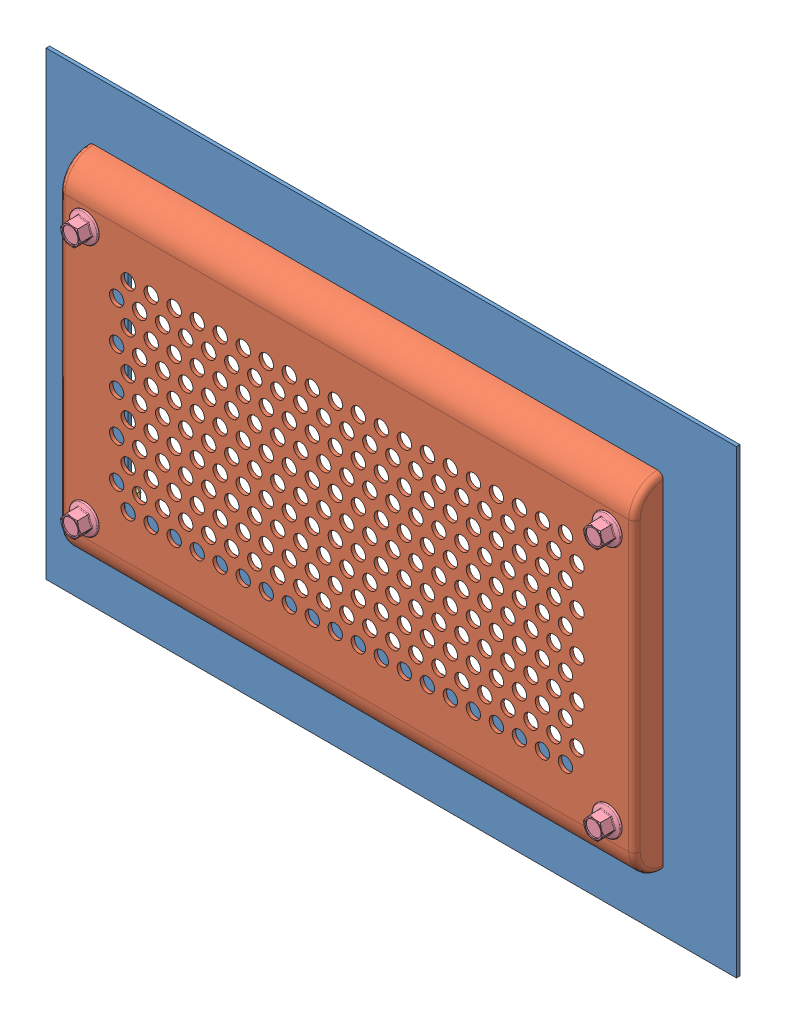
SolidWorks assembly temp cover assy.SLDASM, configuration Default (file format 4628). Lengths in mm.
Overall size (304.8 203.2 28.7).
10 component instances, 4 part files, 11 mates.
Components (placement in the parent):
- reference plate-1: reference plate.SLDPRT [Default] at (-73.3686 49.1354 -0.7601) size (304.8 203.2 1.52)
- cover-1: cover.SLDPRT [Default] at (-87.5274 50.7253 0.7639) size (254 152.4 12.7)
- nut-2: nut.SLDPRT [6mm diameter] at (108.3109 -56.5805 -5.9601) x (-0.923728 -0.383049 0) z (0 0 -1) size (10 11.55 5.2)
- nut-3: nut.SLDPRT [6mm diameter] at (108.3109 54.9329 -0.7601) x (0.504057 0.863671 0) z (0 0 1) size (10 11.55 5.2)
- nut-4: nut.SLDPRT [6mm diameter] at (-122.573 -56.5805 -5.9601) x (0.999784 0.020804 0) z (0 0 -1) size (10 11.55 5.2)
- nut-5: nut.SLDPRT [6mm diameter] at (-122.573 54.9329 -0.7601) x (0.556996 -0.830515 0) z (0 0 1) size (10 11.55 5.2)
- screw-1: screw.sldprt [6mm diameter] at (108.3109 54.9329 20.1639) x (0 0 -1) z (0.935662 0.352897 0) size (28.7 12.8 12.8)
- screw-2: screw.sldprt [6mm diameter] at (-122.573 54.9329 20.1639) x (0 0 -1) z (0.935662 0.352897 0) size (28.7 12.8 12.8)
- screw-3: screw.sldprt [6mm diameter] at (-122.573 -56.5805 20.1639) x (0 0 -1) z (0.935662 0.352897 0) size (28.7 12.8 12.8)
- screw-4: screw.sldprt [6mm diameter] at (108.3109 -56.5805 20.1639) x (0 0 -1) z (0.935662 0.352897 0) size (28.7 12.8 12.8)
Mates (geometry in assembly coordinates):
- Coincident1: coincident anti-aligned: plane of reference plate-1 through (-152.5949 -101.4515 0.7639) normal (0 0 1); plane of cover-1 through (-134.1311 -77.0238 0.7639) normal (0 0 -1)
- Concentric1: concentric aligned: cylinder of reference plate-1 through (108.3109 -56.5805 0.7639) axis (0 0 -1) radius 2.2479; cylinder of nut-2 through (108.3109 -56.5805 19.0774) axis (0 0 -1) radius 3
- Coincident2: coincident anti-aligned: plane of reference plate-1 through (-152.5949 -101.4515 -0.7601) normal (0 0 -1); plane of nut-2 through (106.0994 -51.2474 -0.7601) normal (0 0 1)
- Concentric2: concentric anti-aligned: circle of reference plate-1; circle of nut-5
- Coincident3: coincident anti-aligned: plane of reference plate-1 through (-152.5949 -101.4515 -0.7601) normal (0 0 -1); plane of nut-5 through (-117.7781 58.1488 -0.7601) normal (0 0 1)
- Concentric3: concentric aligned: cylinder of reference plate-1 through (-122.573 -56.5805 0.7639) axis (0 0 -1) radius 2.2479; cylinder of nut-4 through (-122.573 -56.5805 19.0774) axis (0 0 -1) radius 3
- Coincident4: coincident anti-aligned: plane of reference plate-1 through (-152.5949 -101.4515 -0.7601) normal (0 0 -1); plane of nut-4 through (-122.4529 -62.3528 -0.7601) normal (0 0 1)
- Coincident5: coincident anti-aligned: plane of reference plate-1 through (-152.5949 -101.4515 -0.7601) normal (0 0 -1); plane of nut-3 through (103.3245 57.8431 -0.7601) normal (0 0 1)
- Concentric4: concentric anti-aligned: circle of reference plate-1; cylinder of nut-3 through (108.3109 54.9329 -5.9601) axis (0 0 1) radius 2.5
- Concentric5: concentric aligned: cylinder of cover-1 through (108.3109 54.9329 13.4639) axis (0 0 1) radius 3.3; cylinder of screw-1 through (108.3109 54.9329 45.5639) axis (0 0 1) radius 2.5
- Coincident6: coincident anti-aligned: plane of cover-1 through (-134.1311 -77.0238 13.4639) normal (0 0 1); plane of screw-1 through (107.4286 57.2721 13.4639) normal (0 0 -1)
